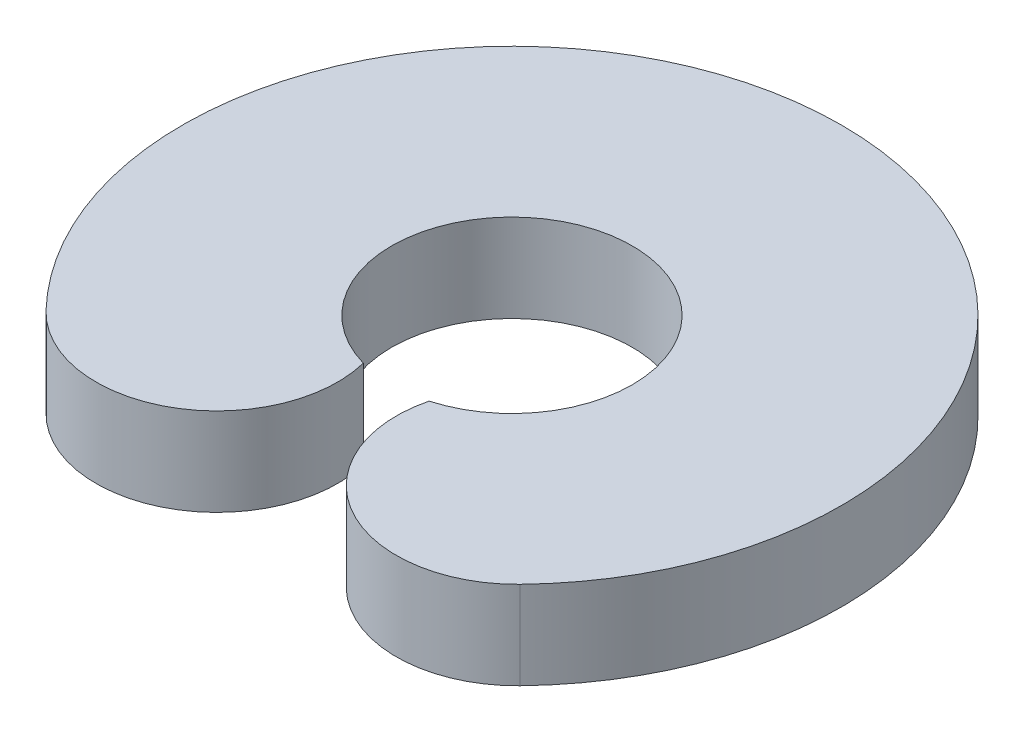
from build123d import *

# Parameters (mm, degrees)
EXTRUDE_1_DEPTH = 200


with BuildPart() as part:
    # Sketch 1 → Extrude 1 (new body)
    with BuildSketch(Plane(origin=(0, 0, 0), x_dir=(1, 0, 0), z_dir=(0, 1, 0))):
        with BuildLine():
            ThreePointArc((74.855080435, -263.434204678), (0, 273.86285484), (-74.855080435, -263.434204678))
            ThreePointArc((-74.855080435, -263.434204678), (-208.363759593, -570.483145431), (-539.504850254, -520.993777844))
            ThreePointArc((-539.504850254, -520.993777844), (0, 750), (539.504850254, -520.993777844))
            ThreePointArc((539.504850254, -520.993777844), (208.363759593, -570.483145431), (74.855080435, -263.434204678))
        make_face()
    extrude(amount=EXTRUDE_1_DEPTH)


solid = part.part
